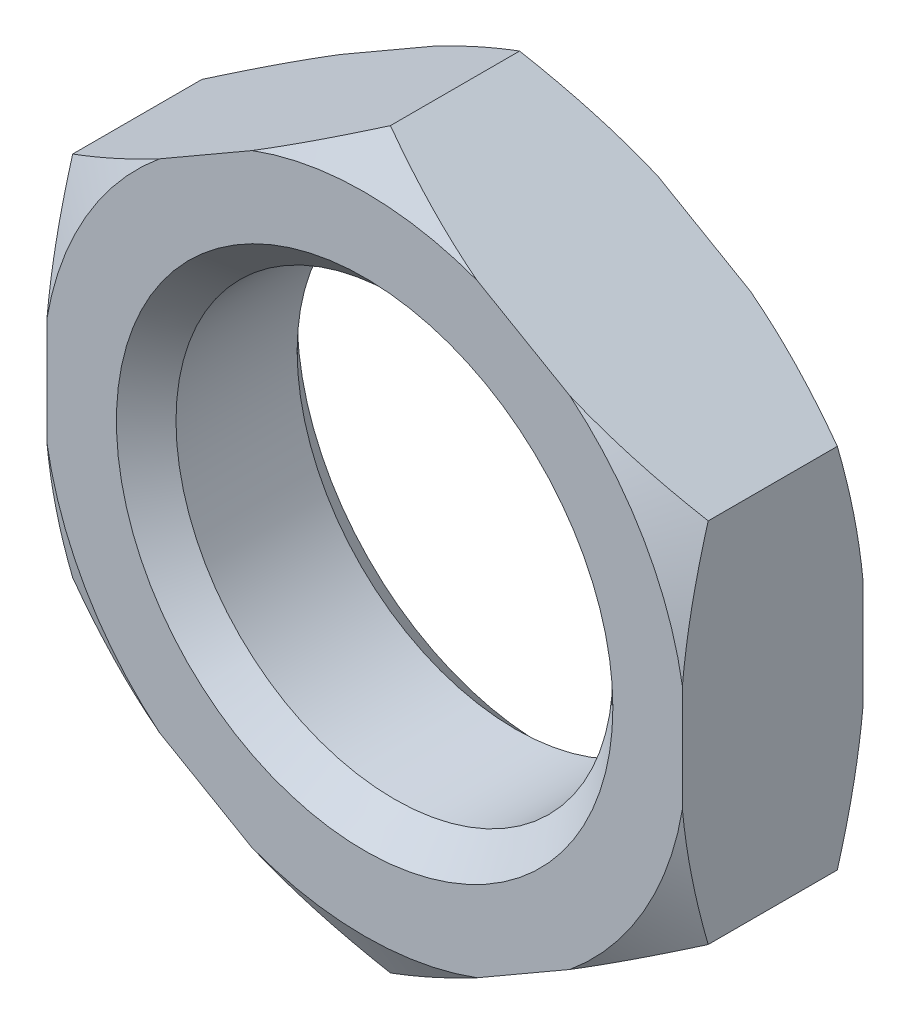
from build123d import *

# Parameters (mm, degrees)
BOSS_EXTRUDE1_DEPTH = 4.55
SKETCH6_R           = 11
CUT_EXTRUDE1_DEPTH  = 9.1
CHAMFER1_SIZE       = 1.5


with BuildPart() as part:
    # Sketch3 → Boss-Extrude1 (new, symmetric)
    with BuildSketch(Plane.XY):
        Polygon((0, 18.475208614), (-16, 9.237604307), (-16, -9.237604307), (0, -18.475208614), (16, -9.237604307), (16, 9.237604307), align=None)
    extrude(amount=BOSS_EXTRUDE1_DEPTH, both=True)

    # Sketch5 → Cut-Revolve1 (revolve, cut)
    with BuildSketch(Plane(origin=(0, 0, 0), x_dir=(0, 0, -1), z_dir=(1, 0, 0))):
        Polygon((-4.55, 18.475208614), (-4.55, 16.225208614), (-3.250961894, 18.475208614), align=None)
    cut_revolve1 = revolve(axis=Axis((0, 0, 5.457798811), (0, 0, -1)), mode=Mode.SUBTRACT)

    # Mirror1: Cut-Revolve1 across plane
    add(cut_revolve1.mirror(Plane.XY), mode=Mode.SUBTRACT)

    # Sketch6 → Cut-Extrude1 (cut)
    with BuildSketch(Plane.XY.offset(4.55)):
        Circle(SKETCH6_R)
    extrude(amount=-CUT_EXTRUDE1_DEPTH, mode=Mode.SUBTRACT)

    # Chamfer1
    chamfer1_edges = [part.edges().sort_by_distance(p)[0] for p in [
        (-11, 0, -4.55),
        (-11, 0, 4.55),
    ]]
    chamfer(chamfer1_edges, length=CHAMFER1_SIZE)


solid = part.part
